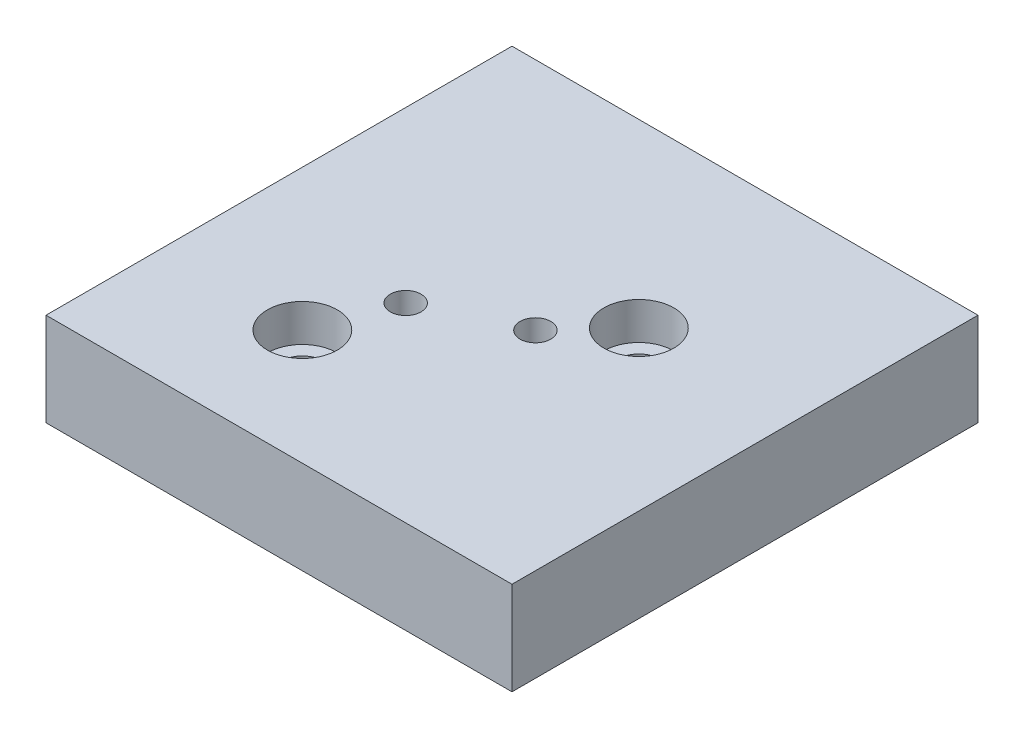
ISO-10303-21;
HEADER;
FILE_DESCRIPTION(('STEP AP214'),'2;1');
FILE_NAME('part.step','',(''),(''),'','','');
FILE_SCHEMA(('AUTOMOTIVE_DESIGN { 1 0 10303 214 1 1 1 1 }'));
ENDSEC;
DATA;
#1=APPLICATION_CONTEXT('core data for automotive mechanical design processes');
#2=APPLICATION_PROTOCOL_DEFINITION('international standard','automotive_design',2000,#1);
#3=PRODUCT_CONTEXT('',#1,'mechanical');
#4=PRODUCT('Part','Part','',(#3));
#5=PRODUCT_RELATED_PRODUCT_CATEGORY('part','',(#4));
#6=PRODUCT_DEFINITION_FORMATION('','',#4);
#7=PRODUCT_DEFINITION_CONTEXT('part definition',#1,'design');
#8=PRODUCT_DEFINITION('design','',#6,#7);
#9=PRODUCT_DEFINITION_SHAPE('','',#8);
#10=(LENGTH_UNIT() NAMED_UNIT(*) SI_UNIT(.MILLI.,.METRE.));
#11=(NAMED_UNIT(*) PLANE_ANGLE_UNIT() SI_UNIT($,.RADIAN.));
#12=(NAMED_UNIT(*) SI_UNIT($,.STERADIAN.) SOLID_ANGLE_UNIT());
#13=UNCERTAINTY_MEASURE_WITH_UNIT(LENGTH_MEASURE(1.E-05),#10,'distance_accuracy_value','');
#14=(GEOMETRIC_REPRESENTATION_CONTEXT(3) GLOBAL_UNCERTAINTY_ASSIGNED_CONTEXT((#13)) GLOBAL_UNIT_ASSIGNED_CONTEXT((#10,
#11,#12)) REPRESENTATION_CONTEXT('',''));
#15=CARTESIAN_POINT('',(0.,0.,0.));
#16=DIRECTION('',(0.,0.,1.));
#17=DIRECTION('',(1.,0.,0.));
#18=AXIS2_PLACEMENT_3D('',#15,#16,#17);
#19=CARTESIAN_POINT('',(0.,0.,-100.));
#20=DIRECTION('',(0.,-1.,0.));
#21=DIRECTION('',(0.,0.,-1.));
#22=AXIS2_PLACEMENT_3D('',#19,#20,#21);
#23=PLANE('',#22);
#24=CARTESIAN_POINT('',(30.2528756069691,0.,-24.7592337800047));
#25=DIRECTION('',(0.,-1.,0.));
#26=DIRECTION('',(0.,0.,-1.));
#27=AXIS2_PLACEMENT_3D('',#24,#25,#26);
#28=CIRCLE('',#27,4.5);
#29=CARTESIAN_POINT('',(30.2528756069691,0.,-29.2592337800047));
#30=VERTEX_POINT('',#29);
#31=EDGE_CURVE('E100',#30,#30,#28,.T.);
#32=ORIENTED_EDGE('',*,*,#31,.F.);
#33=EDGE_LOOP('',(#32));
#34=FACE_BOUND('',#33,.T.);
#35=CARTESIAN_POINT('',(55.3210761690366,0.,-49.7092084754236));
#36=DIRECTION('',(0.,1.,0.));
#37=DIRECTION('',(0.,0.,1.));
#38=AXIS2_PLACEMENT_3D('',#35,#36,#37);
#39=CIRCLE('',#38,3.3);
#40=CARTESIAN_POINT('',(55.3210761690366,0.,-46.4092084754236));
#41=VERTEX_POINT('',#40);
#42=EDGE_CURVE('E103',#41,#41,#39,.T.);
#43=ORIENTED_EDGE('',*,*,#42,.T.);
#44=EDGE_LOOP('',(#43));
#45=FACE_BOUND('',#44,.T.);
#46=DIRECTION('',(0.,0.,1.));
#47=VECTOR('',#46,1.);
#48=CARTESIAN_POINT('',(0.,0.,0.));
#49=LINE('',#48,#47);
#50=CARTESIAN_POINT('',(0.,0.,-100.));
#51=VERTEX_POINT('',#50);
#52=CARTESIAN_POINT('',(0.,0.,0.));
#53=VERTEX_POINT('',#52);
#54=EDGE_CURVE('E115',#51,#53,#49,.T.);
#55=ORIENTED_EDGE('',*,*,#54,.F.);
#56=DIRECTION('',(-1.,0.,0.));
#57=VECTOR('',#56,1.);
#58=CARTESIAN_POINT('',(0.,0.,-100.));
#59=LINE('',#58,#57);
#60=CARTESIAN_POINT('',(100.,0.,-100.));
#61=VERTEX_POINT('',#60);
#62=EDGE_CURVE('E122',#61,#51,#59,.T.);
#63=ORIENTED_EDGE('',*,*,#62,.F.);
#64=DIRECTION('',(0.,0.,-1.));
#65=VECTOR('',#64,1.);
#66=CARTESIAN_POINT('',(100.,0.,0.));
#67=LINE('',#66,#65);
#68=CARTESIAN_POINT('',(100.,0.,0.));
#69=VERTEX_POINT('',#68);
#70=EDGE_CURVE('E120',#69,#61,#67,.T.);
#71=ORIENTED_EDGE('',*,*,#70,.F.);
#72=DIRECTION('',(1.,0.,0.));
#73=VECTOR('',#72,1.);
#74=CARTESIAN_POINT('',(0.,0.,0.));
#75=LINE('',#74,#73);
#76=EDGE_CURVE('E118',#53,#69,#75,.T.);
#77=ORIENTED_EDGE('',*,*,#76,.F.);
#78=EDGE_LOOP('',(#55,#63,#71,#77));
#79=FACE_BOUND('',#78,.T.);
#80=CARTESIAN_POINT('',(36.3268042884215,0.,-40.8565442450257));
#81=DIRECTION('',(0.,1.,0.));
#82=DIRECTION('',(0.,0.,1.));
#83=AXIS2_PLACEMENT_3D('',#80,#81,#82);
#84=CIRCLE('',#83,3.3);
#85=CARTESIAN_POINT('',(36.3268042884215,0.,-37.5565442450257));
#86=VERTEX_POINT('',#85);
#87=EDGE_CURVE('E109',#86,#86,#84,.T.);
#88=ORIENTED_EDGE('',*,*,#87,.T.);
#89=EDGE_LOOP('',(#88));
#90=FACE_BOUND('',#89,.T.);
#91=ADVANCED_FACE('F29',(#34,#45,#79,#90),#23,.T.);
#92=CARTESIAN_POINT('',(0.,20.,0.));
#93=DIRECTION('',(1.,0.,0.));
#94=DIRECTION('',(0.,0.,-1.));
#95=AXIS2_PLACEMENT_3D('',#92,#93,#94);
#96=PLANE('',#95);
#97=ORIENTED_EDGE('',*,*,#54,.T.);
#98=DIRECTION('',(0.,-1.,0.));
#99=VECTOR('',#98,1.);
#100=CARTESIAN_POINT('',(0.,20.,0.));
#101=LINE('',#100,#99);
#102=CARTESIAN_POINT('',(0.,20.,0.));
#103=VERTEX_POINT('',#102);
#104=EDGE_CURVE('E11',#103,#53,#101,.T.);
#105=ORIENTED_EDGE('',*,*,#104,.F.);
#106=DIRECTION('',(0.,0.,1.));
#107=VECTOR('',#106,1.);
#108=CARTESIAN_POINT('',(0.,20.,0.));
#109=LINE('',#108,#107);
#110=CARTESIAN_POINT('',(0.,20.,-100.));
#111=VERTEX_POINT('',#110);
#112=EDGE_CURVE('E124',#111,#103,#109,.T.);
#113=ORIENTED_EDGE('',*,*,#112,.F.);
#114=DIRECTION('',(0.,-1.,0.));
#115=VECTOR('',#114,1.);
#116=CARTESIAN_POINT('',(0.,20.,-100.));
#117=LINE('',#116,#115);
#118=EDGE_CURVE('E130',#111,#51,#117,.T.);
#119=ORIENTED_EDGE('',*,*,#118,.T.);
#120=EDGE_LOOP('',(#97,#105,#113,#119));
#121=FACE_BOUND('',#120,.T.);
#122=ADVANCED_FACE('F31',(#121),#96,.F.);
#123=CARTESIAN_POINT('',(0.,20.,0.));
#124=DIRECTION('',(0.,0.,-1.));
#125=DIRECTION('',(-1.,0.,0.));
#126=AXIS2_PLACEMENT_3D('',#123,#124,#125);
#127=PLANE('',#126);
#128=ORIENTED_EDGE('',*,*,#76,.T.);
#129=DIRECTION('',(0.,-1.,0.));
#130=VECTOR('',#129,1.);
#131=CARTESIAN_POINT('',(100.,20.,0.));
#132=LINE('',#131,#130);
#133=CARTESIAN_POINT('',(100.,20.,0.));
#134=VERTEX_POINT('',#133);
#135=EDGE_CURVE('E37',#134,#69,#132,.T.);
#136=ORIENTED_EDGE('',*,*,#135,.F.);
#137=DIRECTION('',(1.,0.,0.));
#138=VECTOR('',#137,1.);
#139=CARTESIAN_POINT('',(0.,20.,0.));
#140=LINE('',#139,#138);
#141=EDGE_CURVE('E126',#103,#134,#140,.T.);
#142=ORIENTED_EDGE('',*,*,#141,.F.);
#143=ORIENTED_EDGE('',*,*,#104,.T.);
#144=EDGE_LOOP('',(#128,#136,#142,#143));
#145=FACE_BOUND('',#144,.T.);
#146=ADVANCED_FACE('F151',(#145),#127,.F.);
#147=CARTESIAN_POINT('',(100.,20.,0.));
#148=DIRECTION('',(-1.,0.,0.));
#149=DIRECTION('',(0.,0.,1.));
#150=AXIS2_PLACEMENT_3D('',#147,#148,#149);
#151=PLANE('',#150);
#152=ORIENTED_EDGE('',*,*,#70,.T.);
#153=DIRECTION('',(0.,-1.,0.));
#154=VECTOR('',#153,1.);
#155=CARTESIAN_POINT('',(100.,20.,-100.));
#156=LINE('',#155,#154);
#157=CARTESIAN_POINT('',(100.,20.,-100.));
#158=VERTEX_POINT('',#157);
#159=EDGE_CURVE('E133',#158,#61,#156,.T.);
#160=ORIENTED_EDGE('',*,*,#159,.F.);
#161=DIRECTION('',(0.,0.,-1.));
#162=VECTOR('',#161,1.);
#163=CARTESIAN_POINT('',(100.,20.,0.));
#164=LINE('',#163,#162);
#165=EDGE_CURVE('E49',#134,#158,#164,.T.);
#166=ORIENTED_EDGE('',*,*,#165,.F.);
#167=ORIENTED_EDGE('',*,*,#135,.T.);
#168=EDGE_LOOP('',(#152,#160,#166,#167));
#169=FACE_BOUND('',#168,.T.);
#170=ADVANCED_FACE('F139',(#169),#151,.F.);
#171=CARTESIAN_POINT('',(0.,20.,-100.));
#172=DIRECTION('',(0.,0.,1.));
#173=DIRECTION('',(1.,0.,0.));
#174=AXIS2_PLACEMENT_3D('',#171,#172,#173);
#175=PLANE('',#174);
#176=ORIENTED_EDGE('',*,*,#62,.T.);
#177=ORIENTED_EDGE('',*,*,#118,.F.);
#178=DIRECTION('',(-1.,0.,0.));
#179=VECTOR('',#178,1.);
#180=CARTESIAN_POINT('',(0.,20.,-100.));
#181=LINE('',#180,#179);
#182=EDGE_CURVE('E44',#158,#111,#181,.T.);
#183=ORIENTED_EDGE('',*,*,#182,.F.);
#184=ORIENTED_EDGE('',*,*,#159,.T.);
#185=EDGE_LOOP('',(#176,#177,#183,#184));
#186=FACE_BOUND('',#185,.T.);
#187=ADVANCED_FACE('F146',(#186),#175,.F.);
#188=CARTESIAN_POINT('',(0.,20.,-100.));
#189=DIRECTION('',(0.,-1.,0.));
#190=DIRECTION('',(0.,0.,-1.));
#191=AXIS2_PLACEMENT_3D('',#188,#189,#190);
#192=PLANE('',#191);
#193=CARTESIAN_POINT('',(65.9901474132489,20.,-61.2317352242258));
#194=DIRECTION('',(0.,1.,0.));
#195=DIRECTION('',(0.,0.,1.));
#196=AXIS2_PLACEMENT_3D('',#193,#194,#195);
#197=CIRCLE('',#196,7.49999999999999);
#198=CARTESIAN_POINT('',(65.9901474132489,20.,-53.7317352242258));
#199=VERTEX_POINT('',#198);
#200=EDGE_CURVE('E88',#199,#199,#197,.T.);
#201=ORIENTED_EDGE('',*,*,#200,.F.);
#202=EDGE_LOOP('',(#201));
#203=FACE_BOUND('',#202,.T.);
#204=CARTESIAN_POINT('',(30.2528756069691,20.,-24.7592337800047));
#205=DIRECTION('',(0.,1.,0.));
#206=DIRECTION('',(0.,0.,1.));
#207=AXIS2_PLACEMENT_3D('',#204,#205,#206);
#208=CIRCLE('',#207,7.49999999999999);
#209=CARTESIAN_POINT('',(30.2528756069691,20.,-17.2592337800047));
#210=VERTEX_POINT('',#209);
#211=EDGE_CURVE('E91',#210,#210,#208,.T.);
#212=ORIENTED_EDGE('',*,*,#211,.F.);
#213=EDGE_LOOP('',(#212));
#214=FACE_BOUND('',#213,.T.);
#215=CARTESIAN_POINT('',(55.3210761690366,20.,-49.7092084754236));
#216=DIRECTION('',(0.,1.,0.));
#217=DIRECTION('',(0.,0.,1.));
#218=AXIS2_PLACEMENT_3D('',#215,#216,#217);
#219=CIRCLE('',#218,3.29999999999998);
#220=CARTESIAN_POINT('',(55.3210761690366,20.,-46.4092084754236));
#221=VERTEX_POINT('',#220);
#222=EDGE_CURVE('E106',#221,#221,#219,.T.);
#223=ORIENTED_EDGE('',*,*,#222,.F.);
#224=EDGE_LOOP('',(#223));
#225=FACE_BOUND('',#224,.T.);
#226=CARTESIAN_POINT('',(36.3268042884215,20.,-40.8565442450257));
#227=DIRECTION('',(0.,1.,0.));
#228=DIRECTION('',(0.,0.,1.));
#229=AXIS2_PLACEMENT_3D('',#226,#227,#228);
#230=CIRCLE('',#229,3.29999999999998);
#231=CARTESIAN_POINT('',(36.3268042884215,20.,-37.5565442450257));
#232=VERTEX_POINT('',#231);
#233=EDGE_CURVE('E112',#232,#232,#230,.T.);
#234=ORIENTED_EDGE('',*,*,#233,.F.);
#235=EDGE_LOOP('',(#234));
#236=FACE_BOUND('',#235,.T.);
#237=ORIENTED_EDGE('',*,*,#112,.T.);
#238=ORIENTED_EDGE('',*,*,#141,.T.);
#239=ORIENTED_EDGE('',*,*,#165,.T.);
#240=ORIENTED_EDGE('',*,*,#182,.T.);
#241=EDGE_LOOP('',(#237,#238,#239,#240));
#242=FACE_BOUND('',#241,.T.);
#243=ADVANCED_FACE('F150',(#203,#214,#225,#236,#242),#192,.F.);
#244=CARTESIAN_POINT('',(36.3268042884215,20.,-40.8565442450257));
#245=DIRECTION('',(0.,1.,0.));
#246=DIRECTION('',(0.,0.,1.));
#247=AXIS2_PLACEMENT_3D('',#244,#245,#246);
#248=CYLINDRICAL_SURFACE('',#247,3.29999999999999);
#249=ORIENTED_EDGE('',*,*,#87,.F.);
#250=EDGE_LOOP('',(#249));
#251=FACE_BOUND('',#250,.T.);
#252=ORIENTED_EDGE('',*,*,#233,.T.);
#253=EDGE_LOOP('',(#252));
#254=FACE_BOUND('',#253,.T.);
#255=ADVANCED_FACE('F169',(#251,#254),#248,.F.);
#256=CARTESIAN_POINT('',(55.3210761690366,20.,-49.7092084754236));
#257=DIRECTION('',(0.,1.,0.));
#258=DIRECTION('',(0.,0.,1.));
#259=AXIS2_PLACEMENT_3D('',#256,#257,#258);
#260=CYLINDRICAL_SURFACE('',#259,3.29999999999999);
#261=ORIENTED_EDGE('',*,*,#42,.F.);
#262=EDGE_LOOP('',(#261));
#263=FACE_BOUND('',#262,.T.);
#264=ORIENTED_EDGE('',*,*,#222,.T.);
#265=EDGE_LOOP('',(#264));
#266=FACE_BOUND('',#265,.T.);
#267=ADVANCED_FACE('F185',(#263,#266),#260,.F.);
#268=CARTESIAN_POINT('',(30.2528756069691,20.,-24.7592337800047));
#269=DIRECTION('',(0.,1.,0.));
#270=DIRECTION('',(0.,0.,1.));
#271=AXIS2_PLACEMENT_3D('',#268,#269,#270);
#272=CYLINDRICAL_SURFACE('',#271,4.5);
#273=CARTESIAN_POINT('',(30.2528756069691,12.,-24.7592337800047));
#274=DIRECTION('',(0.,1.,0.));
#275=DIRECTION('',(0.,0.,1.));
#276=AXIS2_PLACEMENT_3D('',#273,#274,#275);
#277=CIRCLE('',#276,4.50000000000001);
#278=CARTESIAN_POINT('',(30.2528756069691,12.,-20.2592337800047));
#279=VERTEX_POINT('',#278);
#280=EDGE_CURVE('E97',#279,#279,#277,.T.);
#281=ORIENTED_EDGE('',*,*,#280,.T.);
#282=EDGE_LOOP('',(#281));
#283=FACE_BOUND('',#282,.T.);
#284=ORIENTED_EDGE('',*,*,#31,.T.);
#285=EDGE_LOOP('',(#284));
#286=FACE_BOUND('',#285,.T.);
#287=ADVANCED_FACE('F191',(#283,#286),#272,.F.);
#288=CARTESIAN_POINT('',(34.7528756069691,12.,-24.7592337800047));
#289=DIRECTION('',(0.,-1.,0.));
#290=DIRECTION('',(0.,0.,-1.));
#291=AXIS2_PLACEMENT_3D('',#288,#289,#290);
#292=PLANE('',#291);
#293=ORIENTED_EDGE('',*,*,#280,.F.);
#294=EDGE_LOOP('',(#293));
#295=FACE_BOUND('',#294,.T.);
#296=CARTESIAN_POINT('',(30.2528756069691,12.,-24.7592337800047));
#297=DIRECTION('',(0.,1.,0.));
#298=DIRECTION('',(0.,0.,1.));
#299=AXIS2_PLACEMENT_3D('',#296,#297,#298);
#300=CIRCLE('',#299,7.5);
#301=CARTESIAN_POINT('',(30.2528756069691,12.,-17.2592337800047));
#302=VERTEX_POINT('',#301);
#303=EDGE_CURVE('E94',#302,#302,#300,.T.);
#304=ORIENTED_EDGE('',*,*,#303,.T.);
#305=EDGE_LOOP('',(#304));
#306=FACE_BOUND('',#305,.T.);
#307=ADVANCED_FACE('F199',(#295,#306),#292,.F.);
#308=CARTESIAN_POINT('',(30.2528756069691,20.,-24.7592337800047));
#309=DIRECTION('',(0.,1.,0.));
#310=DIRECTION('',(0.,0.,1.));
#311=AXIS2_PLACEMENT_3D('',#308,#309,#310);
#312=CYLINDRICAL_SURFACE('',#311,7.5);
#313=ORIENTED_EDGE('',*,*,#303,.F.);
#314=EDGE_LOOP('',(#313));
#315=FACE_BOUND('',#314,.T.);
#316=ORIENTED_EDGE('',*,*,#211,.T.);
#317=EDGE_LOOP('',(#316));
#318=FACE_BOUND('',#317,.T.);
#319=ADVANCED_FACE('F207',(#315,#318),#312,.F.);
#320=CARTESIAN_POINT('',(65.9901474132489,20.,-61.2317352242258));
#321=DIRECTION('',(0.,1.,0.));
#322=DIRECTION('',(0.,0.,1.));
#323=AXIS2_PLACEMENT_3D('',#320,#321,#322);
#324=CYLINDRICAL_SURFACE('',#323,7.49999999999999);
#325=CARTESIAN_POINT('',(65.9901474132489,12.,-61.2317352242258));
#326=DIRECTION('',(0.,1.,0.));
#327=DIRECTION('',(0.,0.,1.));
#328=AXIS2_PLACEMENT_3D('',#325,#326,#327);
#329=CIRCLE('',#328,7.49999999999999);
#330=CARTESIAN_POINT('',(65.9901474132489,12.,-53.7317352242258));
#331=VERTEX_POINT('',#330);
#332=EDGE_CURVE('E83',#331,#331,#329,.T.);
#333=ORIENTED_EDGE('',*,*,#332,.F.);
#334=EDGE_LOOP('',(#333));
#335=FACE_BOUND('',#334,.T.);
#336=ORIENTED_EDGE('',*,*,#200,.T.);
#337=EDGE_LOOP('',(#336));
#338=FACE_BOUND('',#337,.T.);
#339=ADVANCED_FACE('F215',(#335,#338),#324,.F.);
#340=CARTESIAN_POINT('',(70.4901474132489,12.,-61.2317352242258));
#341=DIRECTION('',(0.,-1.,0.));
#342=DIRECTION('',(0.,0.,-1.));
#343=AXIS2_PLACEMENT_3D('',#340,#341,#342);
#344=PLANE('',#343);
#345=CARTESIAN_POINT('',(65.9901474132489,12.,-61.2317352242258));
#346=DIRECTION('',(0.,1.,0.));
#347=DIRECTION('',(0.,0.,1.));
#348=AXIS2_PLACEMENT_3D('',#345,#346,#347);
#349=CIRCLE('',#348,4.5);
#350=CARTESIAN_POINT('',(65.9901474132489,12.,-56.7317352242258));
#351=VERTEX_POINT('',#350);
#352=EDGE_CURVE('E80',#351,#351,#349,.T.);
#353=ORIENTED_EDGE('',*,*,#352,.F.);
#354=EDGE_LOOP('',(#353));
#355=FACE_BOUND('',#354,.T.);
#356=ORIENTED_EDGE('',*,*,#332,.T.);
#357=EDGE_LOOP('',(#356));
#358=FACE_BOUND('',#357,.T.);
#359=ADVANCED_FACE('F223',(#355,#358),#344,.F.);
#360=CARTESIAN_POINT('',(65.9901474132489,20.,-61.2317352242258));
#361=DIRECTION('',(0.,1.,0.));
#362=DIRECTION('',(0.,0.,1.));
#363=AXIS2_PLACEMENT_3D('',#360,#361,#362);
#364=CYLINDRICAL_SURFACE('',#363,4.5);
#365=CARTESIAN_POINT('',(65.9901474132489,7.,-61.2317352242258));
#366=DIRECTION('',(0.,1.,0.));
#367=DIRECTION('',(0.,0.,1.));
#368=AXIS2_PLACEMENT_3D('',#365,#366,#367);
#369=CIRCLE('',#368,4.5);
#370=CARTESIAN_POINT('',(65.9901474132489,7.,-56.7317352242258));
#371=VERTEX_POINT('',#370);
#372=EDGE_CURVE('E78',#371,#371,#369,.T.);
#373=ORIENTED_EDGE('',*,*,#372,.F.);
#374=EDGE_LOOP('',(#373));
#375=FACE_BOUND('',#374,.T.);
#376=ORIENTED_EDGE('',*,*,#352,.T.);
#377=EDGE_LOOP('',(#376));
#378=FACE_BOUND('',#377,.T.);
#379=ADVANCED_FACE('F74',(#375,#378),#364,.F.);
#380=CARTESIAN_POINT('',(65.9901474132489,7.,-61.2317352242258));
#381=DIRECTION('',(0.,1.,0.));
#382=DIRECTION('',(0.,0.,1.));
#383=AXIS2_PLACEMENT_3D('',#380,#381,#382);
#384=CONICAL_SURFACE('',#383,4.5,1.02974425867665);
#385=CARTESIAN_POINT('',(65.9901474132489,4.29612721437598,-61.2317352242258));
#386=VERTEX_POINT('',#385);
#387=VERTEX_LOOP('',#386);
#388=FACE_BOUND('',#387,.T.);
#389=ORIENTED_EDGE('',*,*,#372,.T.);
#390=EDGE_LOOP('',(#389));
#391=FACE_BOUND('',#390,.T.);
#392=ADVANCED_FACE('F71',(#388,#391),#384,.F.);
#393=CLOSED_SHELL('',(#91,#122,#146,#170,#187,#243,#255,#267,#287,#307,#319,#339,#359,#379,#392));
#394=MANIFOLD_SOLID_BREP('B2',#393);
#395=ADVANCED_BREP_SHAPE_REPRESENTATION('',(#18,#394),#14);
#396=SHAPE_DEFINITION_REPRESENTATION(#9,#395);
ENDSEC;
END-ISO-10303-21;
